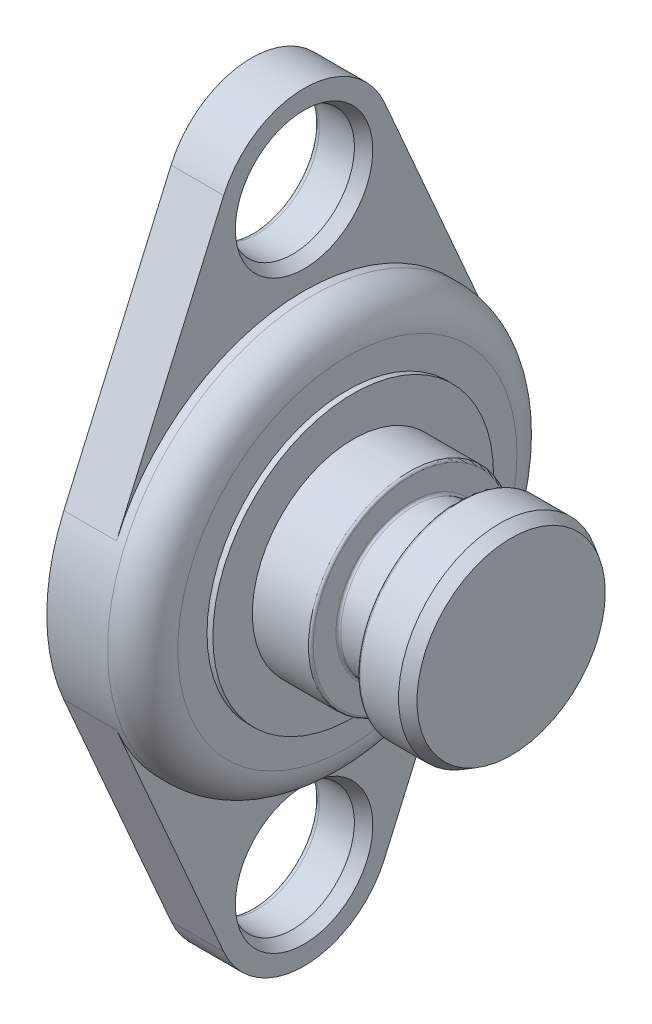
from build123d import *
from OCP.BRepFilletAPI import BRepFilletAPI_MakeChamfer

# Parameters (mm, degrees)
EXTRUSION1_START = 4.5
ESQUISSE2_R      = 5.3
EXTRUSION1_DEPTH = 4.5
CHANFREIN1_SIZE  = 1
CHANFREIN1_SIZE2 = 0.577350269
CONG_1_R         = 0.5


with BuildPart() as part:
    # Esquisse1 → R_volution1 (revolve)
    with BuildSketch(Plane(origin=(0, 0, 0), x_dir=(1, 0, 0), z_dir=(0, 1, 0))):
        with BuildLine():
            Line((0, 0), (0, 8.047649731))
            Line((0, 8.047649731), (-1, 8.625))
            Line((-1, 8.625), (-4.3, 8.625))
            ThreePointArc((-4.3, 8.625), (-4.441421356, 8.566421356), (-4.5, 8.425))
            Line((-4.5, 8.425), (-4.5, 6.475))
            ThreePointArc((-4.5, 6.475), (-4.558578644, 6.333578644), (-4.7, 6.275))
            Line((-4.7, 6.275), (-8.3, 6.275))
            ThreePointArc((-8.3, 6.275), (-8.441421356, 6.333578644), (-8.5, 6.475))
            Line((-8.5, 6.475), (-8.5, 8.425))
            ThreePointArc((-8.5, 8.425), (-8.558578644, 8.566421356), (-8.7, 8.625))
            Line((-8.7, 8.625), (-13.5, 8.625))
            Line((-13.5, 8.625), (-13.5, 12))
            Line((-13.5, 12), (-14, 12))
            Line((-14, 12), (-14, 14.5))
            ThreePointArc((-14, 14.5), (-14.878679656, 16.621320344), (-17, 17.5))
            Line((-17, 17.5), (-17.7, 17.5))
            Line((-17.7, 17.5), (-17.7, 0))
            Line((-17.7, 0), (0, 0))
        make_face()
    revolve(axis=Axis((0, 0, 0), (-1, 0, 0)))

    # Esquisse2 → Extrusion1 (add)
    with BuildSketch(Plane.ZY.offset(17.7).offset(EXTRUSION1_START)):
        with BuildLine():
            Line((-6.873863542, 28), (-16.039014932, 7))
            ThreePointArc((-16.039014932, 7), (-17.5, 0), (-16.039014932, -7))
            Line((-16.039014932, -7), (-6.873863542, -28))
            ThreePointArc((-6.873863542, -28), (0, -32.5), (6.873863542, -28))
            Line((6.873863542, -28), (16.039014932, -7))
            ThreePointArc((16.039014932, -7), (17.5, 0), (16.039014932, 7))
            Line((16.039014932, 7), (6.873863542, 28))
            ThreePointArc((6.873863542, 28), (0, 32.5), (-6.873863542, 28))
        make_face()
        with Locations((0, 25)):
            Circle(ESQUISSE2_R, mode=Mode.SUBTRACT)
        with Locations((0, -25)):
            Circle(ESQUISSE2_R, mode=Mode.SUBTRACT)
    extrude(amount=-EXTRUSION1_DEPTH)

    # Chanfrein1: one chamfer whose edges measure the first distance from different faces: ONE call of the kernel's chamfer builder (chamfer() names one face for all edges)
    chanfrein1_edges_1 = [part.edges().sort_by_distance(p)[0] for p in [
        (-17.7, 25, -5.3),
    ]]
    chanfrein1_side_1 = [part.faces().sort_by_distance(p)[0] for p in [
        (-19.95, 25, -5.3),
    ]]
    chanfrein1_edges_2 = [part.edges().sort_by_distance(p)[0] for p in [
        (-17.7, -25, -5.3),
    ]]
    chanfrein1_side_2 = [part.faces().sort_by_distance(p)[0] for p in [
        (-19.95, -25, -5.3),
    ]]
    chanfrein1 = BRepFilletAPI_MakeChamfer(part.part.solid().wrapped)
    for e in chanfrein1_edges_1:
        chanfrein1.Add(CHANFREIN1_SIZE, CHANFREIN1_SIZE2, e.wrapped, chanfrein1_side_1[0].wrapped)  # the first distance lies on this face
    for e in chanfrein1_edges_2:
        chanfrein1.Add(CHANFREIN1_SIZE, CHANFREIN1_SIZE2, e.wrapped, chanfrein1_side_2[0].wrapped)  # the first distance lies on this face
    add(Compound.cast(chanfrein1.Shape()), mode=Mode.REPLACE)

    # Cong_1
    cong_1_edges = [part.edges().sort_by_distance(p)[0] for p in [
        (-22.2, 25, -5.3),
        (-22.2, -25, -5.3),
    ]]
    fillet(cong_1_edges, radius=CONG_1_R)


solid = part.part
